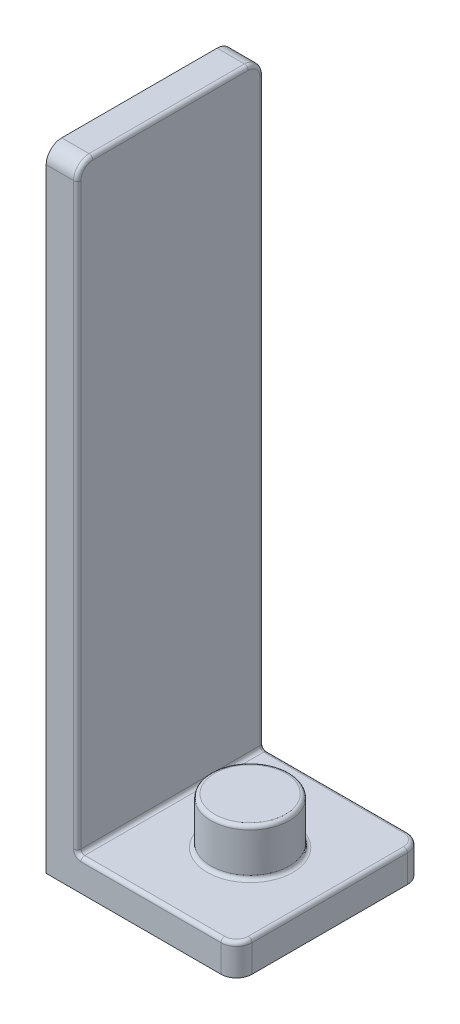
ISO-10303-21;
HEADER;
FILE_DESCRIPTION(('STEP AP214'),'2;1');
FILE_NAME('part.step','',(''),(''),'','','');
FILE_SCHEMA(('AUTOMOTIVE_DESIGN { 1 0 10303 214 1 1 1 1 }'));
ENDSEC;
DATA;
#1=APPLICATION_CONTEXT('core data for automotive mechanical design processes');
#2=APPLICATION_PROTOCOL_DEFINITION('international standard','automotive_design',2000,#1);
#3=PRODUCT_CONTEXT('',#1,'mechanical');
#4=PRODUCT('Part','Part','',(#3));
#5=PRODUCT_RELATED_PRODUCT_CATEGORY('part','',(#4));
#6=PRODUCT_DEFINITION_FORMATION('','',#4);
#7=PRODUCT_DEFINITION_CONTEXT('part definition',#1,'design');
#8=PRODUCT_DEFINITION('design','',#6,#7);
#9=PRODUCT_DEFINITION_SHAPE('','',#8);
#10=(LENGTH_UNIT() NAMED_UNIT(*) SI_UNIT(.MILLI.,.METRE.));
#11=(NAMED_UNIT(*) PLANE_ANGLE_UNIT() SI_UNIT($,.RADIAN.));
#12=(NAMED_UNIT(*) SI_UNIT($,.STERADIAN.) SOLID_ANGLE_UNIT());
#13=UNCERTAINTY_MEASURE_WITH_UNIT(LENGTH_MEASURE(1.E-05),#10,'distance_accuracy_value','');
#14=(GEOMETRIC_REPRESENTATION_CONTEXT(3) GLOBAL_UNCERTAINTY_ASSIGNED_CONTEXT((#13)) GLOBAL_UNIT_ASSIGNED_CONTEXT((#10,
#11,#12)) REPRESENTATION_CONTEXT('',''));
#15=CARTESIAN_POINT('',(0.,0.,0.));
#16=DIRECTION('',(0.,0.,1.));
#17=DIRECTION('',(1.,0.,0.));
#18=AXIS2_PLACEMENT_3D('',#15,#16,#17);
#19=CARTESIAN_POINT('',(0.,0.,38.1));
#20=DIRECTION('',(0.,1.,0.));
#21=DIRECTION('',(-1.,0.,0.));
#22=AXIS2_PLACEMENT_3D('',#19,#20,#21);
#23=PLANE('',#22);
#24=CARTESIAN_POINT('',(58.7375,0.,-31.75));
#25=DIRECTION('',(0.,1.,0.));
#26=DIRECTION('',(-1.,0.,0.));
#27=AXIS2_PLACEMENT_3D('',#24,#25,#26);
#28=CIRCLE('',#27,4.826);
#29=CARTESIAN_POINT('',(63.5635,0.,-31.75));
#30=VERTEX_POINT('',#29);
#31=CARTESIAN_POINT('',(58.7375,0.,-36.576));
#32=VERTEX_POINT('',#31);
#33=EDGE_CURVE('E259',#30,#32,#28,.T.);
#34=ORIENTED_EDGE('',*,*,#33,.T.);
#35=DIRECTION('',(1.,0.,0.));
#36=VECTOR('',#35,1.);
#37=CARTESIAN_POINT('',(0.,0.,-36.576));
#38=LINE('',#37,#36);
#39=CARTESIAN_POINT('',(1.524,0.,-36.576));
#40=VERTEX_POINT('',#39);
#41=EDGE_CURVE('E261',#32,#40,#38,.F.);
#42=ORIENTED_EDGE('',*,*,#41,.T.);
#43=DIRECTION('',(0.,0.,-1.));
#44=VECTOR('',#43,1.);
#45=CARTESIAN_POINT('',(1.524,0.,38.1));
#46=LINE('',#45,#44);
#47=CARTESIAN_POINT('',(1.524,0.,36.576));
#48=VERTEX_POINT('',#47);
#49=EDGE_CURVE('E251',#40,#48,#46,.F.);
#50=ORIENTED_EDGE('',*,*,#49,.T.);
#51=DIRECTION('',(1.,0.,0.));
#52=VECTOR('',#51,1.);
#53=CARTESIAN_POINT('',(58.7375,0.,36.576));
#54=LINE('',#53,#52);
#55=CARTESIAN_POINT('',(58.7375,0.,36.576));
#56=VERTEX_POINT('',#55);
#57=EDGE_CURVE('E253',#48,#56,#54,.T.);
#58=ORIENTED_EDGE('',*,*,#57,.T.);
#59=CARTESIAN_POINT('',(58.7375,0.,31.75));
#60=DIRECTION('',(0.,1.,0.));
#61=DIRECTION('',(-1.,0.,0.));
#62=AXIS2_PLACEMENT_3D('',#59,#60,#61);
#63=CIRCLE('',#62,4.826);
#64=CARTESIAN_POINT('',(63.5635,0.,31.75));
#65=VERTEX_POINT('',#64);
#66=EDGE_CURVE('E255',#56,#65,#63,.T.);
#67=ORIENTED_EDGE('',*,*,#66,.T.);
#68=DIRECTION('',(0.,0.,-1.));
#69=VECTOR('',#68,1.);
#70=CARTESIAN_POINT('',(63.5635,0.,38.1));
#71=LINE('',#70,#69);
#72=EDGE_CURVE('E257',#65,#30,#71,.T.);
#73=ORIENTED_EDGE('',*,*,#72,.T.);
#74=EDGE_LOOP('',(#34,#42,#50,#58,#67,#73));
#75=FACE_BOUND('',#74,.T.);
#76=CARTESIAN_POINT('',(32.54375,0.,0.));
#77=DIRECTION('',(0.,1.,0.));
#78=DIRECTION('',(-1.,0.,0.));
#79=AXIS2_PLACEMENT_3D('',#76,#77,#78);
#80=CIRCLE('',#79,17.5508006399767);
#81=CARTESIAN_POINT('',(14.9929493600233,0.,0.));
#82=VERTEX_POINT('',#81);
#83=EDGE_CURVE('E248',#82,#82,#80,.F.);
#84=ORIENTED_EDGE('',*,*,#83,.T.);
#85=EDGE_LOOP('',(#84));
#86=FACE_BOUND('',#85,.T.);
#87=ADVANCED_FACE('F31',(#75,#86),#23,.T.);
#88=CARTESIAN_POINT('',(0.,-12.7,38.1));
#89=DIRECTION('',(0.,1.,0.));
#90=DIRECTION('',(-1.,0.,0.));
#91=AXIS2_PLACEMENT_3D('',#88,#89,#90);
#92=PLANE('',#91);
#93=DIRECTION('',(1.,0.,0.));
#94=VECTOR('',#93,1.);
#95=CARTESIAN_POINT('',(0.,-12.7,-38.1));
#96=LINE('',#95,#94);
#97=CARTESIAN_POINT('',(-12.7,-12.7,-38.1));
#98=VERTEX_POINT('',#97);
#99=CARTESIAN_POINT('',(58.7375,-12.7,-38.1));
#100=VERTEX_POINT('',#99);
#101=EDGE_CURVE('E182',#98,#100,#96,.T.);
#102=ORIENTED_EDGE('',*,*,#101,.T.);
#103=CARTESIAN_POINT('',(58.7375,-12.7,-31.75));
#104=DIRECTION('',(0.,1.,0.));
#105=DIRECTION('',(-1.,0.,0.));
#106=AXIS2_PLACEMENT_3D('',#103,#104,#105);
#107=CIRCLE('',#106,6.35);
#108=CARTESIAN_POINT('',(65.0875,-12.7,-31.75));
#109=VERTEX_POINT('',#108);
#110=EDGE_CURVE('E196',#100,#109,#107,.F.);
#111=ORIENTED_EDGE('',*,*,#110,.T.);
#112=DIRECTION('',(0.,0.,-1.));
#113=VECTOR('',#112,1.);
#114=CARTESIAN_POINT('',(65.0875,-12.7,38.1));
#115=LINE('',#114,#113);
#116=CARTESIAN_POINT('',(65.0875,-12.7,31.75));
#117=VERTEX_POINT('',#116);
#118=EDGE_CURVE('E187',#117,#109,#115,.T.);
#119=ORIENTED_EDGE('',*,*,#118,.F.);
#120=CARTESIAN_POINT('',(58.7375,-12.7,31.75));
#121=DIRECTION('',(0.,1.,0.));
#122=DIRECTION('',(-1.,0.,0.));
#123=AXIS2_PLACEMENT_3D('',#120,#121,#122);
#124=CIRCLE('',#123,6.35);
#125=CARTESIAN_POINT('',(58.7375,-12.7,38.1));
#126=VERTEX_POINT('',#125);
#127=EDGE_CURVE('E180',#117,#126,#124,.F.);
#128=ORIENTED_EDGE('',*,*,#127,.T.);
#129=DIRECTION('',(1.,0.,0.));
#130=VECTOR('',#129,1.);
#131=CARTESIAN_POINT('',(0.,-12.7,38.1));
#132=LINE('',#131,#130);
#133=CARTESIAN_POINT('',(-12.7,-12.7,38.1));
#134=VERTEX_POINT('',#133);
#135=EDGE_CURVE('E159',#134,#126,#132,.T.);
#136=ORIENTED_EDGE('',*,*,#135,.F.);
#137=DIRECTION('',(0.,0.,-1.));
#138=VECTOR('',#137,1.);
#139=CARTESIAN_POINT('',(-12.7,-12.7,38.1));
#140=LINE('',#139,#138);
#141=EDGE_CURVE('E165',#134,#98,#140,.T.);
#142=ORIENTED_EDGE('',*,*,#141,.T.);
#143=EDGE_LOOP('',(#102,#111,#119,#128,#136,#142));
#144=FACE_BOUND('',#143,.T.);
#145=ADVANCED_FACE('F177',(#144),#92,.F.);
#146=CARTESIAN_POINT('',(65.0875,0.,38.1));
#147=DIRECTION('',(1.,0.,0.));
#148=DIRECTION('',(0.,0.,-1.));
#149=AXIS2_PLACEMENT_3D('',#146,#147,#148);
#150=PLANE('',#149);
#151=DIRECTION('',(0.,-1.,0.));
#152=VECTOR('',#151,1.);
#153=CARTESIAN_POINT('',(65.0875,0.,-31.75));
#154=LINE('',#153,#152);
#155=CARTESIAN_POINT('',(65.0875,-1.524,-31.75));
#156=VERTEX_POINT('',#155);
#157=EDGE_CURVE('E200',#109,#156,#154,.F.);
#158=ORIENTED_EDGE('',*,*,#157,.T.);
#159=DIRECTION('',(0.,0.,-1.));
#160=VECTOR('',#159,1.);
#161=CARTESIAN_POINT('',(65.0875,-1.524,38.1));
#162=LINE('',#161,#160);
#163=CARTESIAN_POINT('',(65.0875,-1.52399999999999,31.75));
#164=VERTEX_POINT('',#163);
#165=EDGE_CURVE('E48',#156,#164,#162,.F.);
#166=ORIENTED_EDGE('',*,*,#165,.T.);
#167=DIRECTION('',(0.,-1.,0.));
#168=VECTOR('',#167,1.);
#169=CARTESIAN_POINT('',(65.0875,-12.7,31.75));
#170=LINE('',#169,#168);
#171=EDGE_CURVE('E198',#164,#117,#170,.T.);
#172=ORIENTED_EDGE('',*,*,#171,.T.);
#173=ORIENTED_EDGE('',*,*,#118,.T.);
#174=EDGE_LOOP('',(#158,#166,#172,#173));
#175=FACE_BOUND('',#174,.T.);
#176=ADVANCED_FACE('F340',(#175),#150,.T.);
#177=CARTESIAN_POINT('',(0.,244.475,38.1));
#178=DIRECTION('',(1.,0.,0.));
#179=DIRECTION('',(0.,1.,0.));
#180=AXIS2_PLACEMENT_3D('',#177,#178,#179);
#181=PLANE('',#180);
#182=CARTESIAN_POINT('',(0.,238.125,-31.75));
#183=DIRECTION('',(1.,0.,0.));
#184=DIRECTION('',(0.,1.,0.));
#185=AXIS2_PLACEMENT_3D('',#182,#183,#184);
#186=CIRCLE('',#185,4.826);
#187=CARTESIAN_POINT('',(0.,238.125,-36.576));
#188=VERTEX_POINT('',#187);
#189=CARTESIAN_POINT('',(0.,242.951,-31.75));
#190=VERTEX_POINT('',#189);
#191=EDGE_CURVE('E225',#188,#190,#186,.T.);
#192=ORIENTED_EDGE('',*,*,#191,.T.);
#193=DIRECTION('',(0.,0.,-1.));
#194=VECTOR('',#193,1.);
#195=CARTESIAN_POINT('',(0.,242.951,38.1));
#196=LINE('',#195,#194);
#197=CARTESIAN_POINT('',(0.,242.951,31.75));
#198=VERTEX_POINT('',#197);
#199=EDGE_CURVE('E227',#190,#198,#196,.F.);
#200=ORIENTED_EDGE('',*,*,#199,.T.);
#201=CARTESIAN_POINT('',(0.,238.125,31.75));
#202=DIRECTION('',(1.,0.,0.));
#203=DIRECTION('',(0.,1.,0.));
#204=AXIS2_PLACEMENT_3D('',#201,#202,#203);
#205=CIRCLE('',#204,4.826);
#206=CARTESIAN_POINT('',(0.,238.125,36.576));
#207=VERTEX_POINT('',#206);
#208=EDGE_CURVE('E223',#198,#207,#205,.T.);
#209=ORIENTED_EDGE('',*,*,#208,.T.);
#210=DIRECTION('',(0.,-1.,0.));
#211=VECTOR('',#210,1.);
#212=CARTESIAN_POINT('',(0.,0.,36.576));
#213=LINE('',#212,#211);
#214=CARTESIAN_POINT('',(0.,1.524,36.576));
#215=VERTEX_POINT('',#214);
#216=EDGE_CURVE('E219',#207,#215,#213,.T.);
#217=ORIENTED_EDGE('',*,*,#216,.T.);
#218=DIRECTION('',(0.,0.,-1.));
#219=VECTOR('',#218,1.);
#220=CARTESIAN_POINT('',(0.,1.524,-38.1));
#221=LINE('',#220,#219);
#222=CARTESIAN_POINT('',(0.,1.524,-36.576));
#223=VERTEX_POINT('',#222);
#224=EDGE_CURVE('E217',#215,#223,#221,.T.);
#225=ORIENTED_EDGE('',*,*,#224,.T.);
#226=DIRECTION('',(0.,-1.,0.));
#227=VECTOR('',#226,1.);
#228=CARTESIAN_POINT('',(0.,244.475,-36.576));
#229=LINE('',#228,#227);
#230=EDGE_CURVE('E221',#223,#188,#229,.F.);
#231=ORIENTED_EDGE('',*,*,#230,.T.);
#232=EDGE_LOOP('',(#192,#200,#209,#217,#225,#231));
#233=FACE_BOUND('',#232,.T.);
#234=ADVANCED_FACE('F361',(#233),#181,.T.);
#235=CARTESIAN_POINT('',(-12.7,244.475,38.1));
#236=DIRECTION('',(0.,1.,0.));
#237=DIRECTION('',(0.,0.,1.));
#238=AXIS2_PLACEMENT_3D('',#235,#236,#237);
#239=PLANE('',#238);
#240=DIRECTION('',(1.,0.,0.));
#241=VECTOR('',#240,1.);
#242=CARTESIAN_POINT('',(0.,244.475,31.75));
#243=LINE('',#242,#241);
#244=CARTESIAN_POINT('',(-12.7,244.475,31.75));
#245=VERTEX_POINT('',#244);
#246=CARTESIAN_POINT('',(-1.524,244.475,31.75));
#247=VERTEX_POINT('',#246);
#248=EDGE_CURVE('E205',#245,#247,#243,.T.);
#249=ORIENTED_EDGE('',*,*,#248,.T.);
#250=DIRECTION('',(0.,0.,-1.));
#251=VECTOR('',#250,1.);
#252=CARTESIAN_POINT('',(-1.524,244.475,38.1));
#253=LINE('',#252,#251);
#254=CARTESIAN_POINT('',(-1.524,244.475,-31.75));
#255=VERTEX_POINT('',#254);
#256=EDGE_CURVE('E214',#247,#255,#253,.T.);
#257=ORIENTED_EDGE('',*,*,#256,.T.);
#258=DIRECTION('',(1.,0.,0.));
#259=VECTOR('',#258,1.);
#260=CARTESIAN_POINT('',(-12.7,244.475,-31.75));
#261=LINE('',#260,#259);
#262=CARTESIAN_POINT('',(-12.7,244.475,-31.75));
#263=VERTEX_POINT('',#262);
#264=EDGE_CURVE('E208',#255,#263,#261,.F.);
#265=ORIENTED_EDGE('',*,*,#264,.T.);
#266=DIRECTION('',(0.,0.,-1.));
#267=VECTOR('',#266,1.);
#268=CARTESIAN_POINT('',(-12.7,244.475,38.1));
#269=LINE('',#268,#267);
#270=EDGE_CURVE('E175',#245,#263,#269,.T.);
#271=ORIENTED_EDGE('',*,*,#270,.F.);
#272=EDGE_LOOP('',(#249,#257,#265,#271));
#273=FACE_BOUND('',#272,.T.);
#274=ADVANCED_FACE('F378',(#273),#239,.T.);
#275=CARTESIAN_POINT('',(-12.7,244.475,38.1));
#276=DIRECTION('',(1.,0.,0.));
#277=DIRECTION('',(0.,1.,0.));
#278=AXIS2_PLACEMENT_3D('',#275,#276,#277);
#279=PLANE('',#278);
#280=ORIENTED_EDGE('',*,*,#270,.T.);
#281=CARTESIAN_POINT('',(-12.7,238.125,-31.75));
#282=DIRECTION('',(1.,0.,0.));
#283=DIRECTION('',(0.,1.,0.));
#284=AXIS2_PLACEMENT_3D('',#281,#282,#283);
#285=CIRCLE('',#284,6.35);
#286=CARTESIAN_POINT('',(-12.7,238.125,-38.1));
#287=VERTEX_POINT('',#286);
#288=EDGE_CURVE('E212',#263,#287,#285,.F.);
#289=ORIENTED_EDGE('',*,*,#288,.T.);
#290=DIRECTION('',(0.,-1.,0.));
#291=VECTOR('',#290,1.);
#292=CARTESIAN_POINT('',(-12.7,244.475,-38.1));
#293=LINE('',#292,#291);
#294=EDGE_CURVE('E171',#287,#98,#293,.T.);
#295=ORIENTED_EDGE('',*,*,#294,.T.);
#296=ORIENTED_EDGE('',*,*,#141,.F.);
#297=DIRECTION('',(0.,-1.,0.));
#298=VECTOR('',#297,1.);
#299=CARTESIAN_POINT('',(-12.7,244.475,38.1));
#300=LINE('',#299,#298);
#301=CARTESIAN_POINT('',(-12.7,238.125,38.1));
#302=VERTEX_POINT('',#301);
#303=EDGE_CURVE('E154',#302,#134,#300,.T.);
#304=ORIENTED_EDGE('',*,*,#303,.F.);
#305=CARTESIAN_POINT('',(-12.7,238.125,31.75));
#306=DIRECTION('',(1.,0.,0.));
#307=DIRECTION('',(0.,1.,0.));
#308=AXIS2_PLACEMENT_3D('',#305,#306,#307);
#309=CIRCLE('',#308,6.35);
#310=EDGE_CURVE('E210',#302,#245,#309,.F.);
#311=ORIENTED_EDGE('',*,*,#310,.T.);
#312=EDGE_LOOP('',(#280,#289,#295,#296,#304,#311));
#313=FACE_BOUND('',#312,.T.);
#314=ADVANCED_FACE('F169',(#313),#279,.F.);
#315=CARTESIAN_POINT('',(65.0875,-12.7,38.1));
#316=DIRECTION('',(0.,0.,-1.));
#317=DIRECTION('',(-1.,0.,0.));
#318=AXIS2_PLACEMENT_3D('',#315,#316,#317);
#319=PLANE('',#318);
#320=CARTESIAN_POINT('',(1.524,1.524,38.1));
#321=DIRECTION('',(0.,0.,-1.));
#322=DIRECTION('',(-1.,0.,0.));
#323=AXIS2_PLACEMENT_3D('',#320,#321,#322);
#324=CIRCLE('',#323,3.048);
#325=CARTESIAN_POINT('',(-1.524,1.524,38.1));
#326=VERTEX_POINT('',#325);
#327=CARTESIAN_POINT('',(1.524,-1.524,38.1));
#328=VERTEX_POINT('',#327);
#329=EDGE_CURVE('E241',#326,#328,#324,.F.);
#330=ORIENTED_EDGE('',*,*,#329,.F.);
#331=DIRECTION('',(0.,-1.,0.));
#332=VECTOR('',#331,1.);
#333=CARTESIAN_POINT('',(-1.524,238.125,38.1));
#334=LINE('',#333,#332);
#335=CARTESIAN_POINT('',(-1.524,238.125,38.1));
#336=VERTEX_POINT('',#335);
#337=EDGE_CURVE('E246',#326,#336,#334,.F.);
#338=ORIENTED_EDGE('',*,*,#337,.T.);
#339=DIRECTION('',(1.,0.,0.));
#340=VECTOR('',#339,1.);
#341=CARTESIAN_POINT('',(-12.7,238.125,38.1));
#342=LINE('',#341,#340);
#343=EDGE_CURVE('E162',#336,#302,#342,.F.);
#344=ORIENTED_EDGE('',*,*,#343,.T.);
#345=ORIENTED_EDGE('',*,*,#303,.T.);
#346=ORIENTED_EDGE('',*,*,#135,.T.);
#347=DIRECTION('',(0.,-1.,0.));
#348=VECTOR('',#347,1.);
#349=CARTESIAN_POINT('',(58.7375,0.,38.1));
#350=LINE('',#349,#348);
#351=CARTESIAN_POINT('',(58.7375,-1.524,38.1));
#352=VERTEX_POINT('',#351);
#353=EDGE_CURVE('E203',#126,#352,#350,.F.);
#354=ORIENTED_EDGE('',*,*,#353,.T.);
#355=DIRECTION('',(1.,0.,0.));
#356=VECTOR('',#355,1.);
#357=CARTESIAN_POINT('',(0.,-1.524,38.1));
#358=LINE('',#357,#356);
#359=EDGE_CURVE('E244',#352,#328,#358,.F.);
#360=ORIENTED_EDGE('',*,*,#359,.T.);
#361=EDGE_LOOP('',(#330,#338,#344,#345,#346,#354,#360));
#362=FACE_BOUND('',#361,.T.);
#363=ADVANCED_FACE('F156',(#362),#319,.F.);
#364=CARTESIAN_POINT('',(65.0875,-12.7,-38.1));
#365=DIRECTION('',(0.,0.,-1.));
#366=DIRECTION('',(-1.,0.,0.));
#367=AXIS2_PLACEMENT_3D('',#364,#365,#366);
#368=PLANE('',#367);
#369=DIRECTION('',(1.,0.,0.));
#370=VECTOR('',#369,1.);
#371=CARTESIAN_POINT('',(65.0875,238.125,-38.1));
#372=LINE('',#371,#370);
#373=CARTESIAN_POINT('',(-1.524,238.125,-38.1));
#374=VERTEX_POINT('',#373);
#375=EDGE_CURVE('E190',#287,#374,#372,.T.);
#376=ORIENTED_EDGE('',*,*,#375,.T.);
#377=DIRECTION('',(0.,-1.,0.));
#378=VECTOR('',#377,1.);
#379=CARTESIAN_POINT('',(-1.524,-12.7,-38.1));
#380=LINE('',#379,#378);
#381=CARTESIAN_POINT('',(-1.524,1.524,-38.1));
#382=VERTEX_POINT('',#381);
#383=EDGE_CURVE('E239',#374,#382,#380,.T.);
#384=ORIENTED_EDGE('',*,*,#383,.T.);
#385=CARTESIAN_POINT('',(1.524,1.524,-38.1));
#386=DIRECTION('',(0.,0.,-1.));
#387=DIRECTION('',(-1.,0.,0.));
#388=AXIS2_PLACEMENT_3D('',#385,#386,#387);
#389=CIRCLE('',#388,3.048);
#390=CARTESIAN_POINT('',(1.524,-1.524,-38.1));
#391=VERTEX_POINT('',#390);
#392=EDGE_CURVE('E236',#391,#382,#389,.T.);
#393=ORIENTED_EDGE('',*,*,#392,.F.);
#394=DIRECTION('',(1.,0.,0.));
#395=VECTOR('',#394,1.);
#396=CARTESIAN_POINT('',(65.0875,-1.524,-38.1));
#397=LINE('',#396,#395);
#398=CARTESIAN_POINT('',(58.7375,-1.524,-38.1));
#399=VERTEX_POINT('',#398);
#400=EDGE_CURVE('E234',#391,#399,#397,.T.);
#401=ORIENTED_EDGE('',*,*,#400,.T.);
#402=DIRECTION('',(0.,-1.,0.));
#403=VECTOR('',#402,1.);
#404=CARTESIAN_POINT('',(58.7375,-12.7,-38.1));
#405=LINE('',#404,#403);
#406=EDGE_CURVE('E193',#399,#100,#405,.T.);
#407=ORIENTED_EDGE('',*,*,#406,.T.);
#408=ORIENTED_EDGE('',*,*,#101,.F.);
#409=ORIENTED_EDGE('',*,*,#294,.F.);
#410=EDGE_LOOP('',(#376,#384,#393,#401,#407,#408,#409));
#411=FACE_BOUND('',#410,.T.);
#412=ADVANCED_FACE('F344',(#411),#368,.T.);
#413=CARTESIAN_POINT('',(32.54375,19.05,0.));
#414=DIRECTION('',(0.,-1.,0.));
#415=DIRECTION('',(0.,0.,-1.));
#416=AXIS2_PLACEMENT_3D('',#413,#414,#415);
#417=CYLINDRICAL_SURFACE('',#416,16.0268006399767);
#418=CARTESIAN_POINT('',(32.54375,17.526,0.));
#419=DIRECTION('',(0.,1.,0.));
#420=DIRECTION('',(0.,0.,1.));
#421=AXIS2_PLACEMENT_3D('',#418,#419,#420);
#422=CIRCLE('',#421,16.0268006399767);
#423=CARTESIAN_POINT('',(32.54375,17.526,-16.0268006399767));
#424=VERTEX_POINT('',#423);
#425=EDGE_CURVE('E11',#424,#424,#422,.F.);
#426=CARTESIAN_POINT('',(32.54375,1.52400000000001,0.));
#427=DIRECTION('',(0.,1.,0.));
#428=DIRECTION('',(-1.,0.,0.));
#429=AXIS2_PLACEMENT_3D('',#426,#427,#428);
#430=CIRCLE('',#429,16.0268006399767);
#431=CARTESIAN_POINT('',(32.54375,1.52400000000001,-16.0268006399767));
#432=VERTEX_POINT('',#431);
#433=EDGE_CURVE('E40',#432,#432,#430,.T.);
#434=CARTESIAN_POINT('',(32.54375,17.526,-16.0268006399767));
#435=CARTESIAN_POINT('',(32.54375,17.3593125,-16.0268006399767));
#436=CARTESIAN_POINT('',(32.54375,17.192625,-16.0268006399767));
#437=CARTESIAN_POINT('',(32.54375,16.85925,-16.0268006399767));
#438=CARTESIAN_POINT('',(32.54375,16.6925625,-16.0268006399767));
#439=CARTESIAN_POINT('',(32.54375,16.3591875,-16.0268006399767));
#440=CARTESIAN_POINT('',(32.54375,16.1925,-16.0268006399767));
#441=CARTESIAN_POINT('',(32.54375,15.859125,-16.0268006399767));
#442=CARTESIAN_POINT('',(32.54375,15.6924375,-16.0268006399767));
#443=CARTESIAN_POINT('',(32.54375,15.3590625,-16.0268006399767));
#444=CARTESIAN_POINT('',(32.54375,15.192375,-16.0268006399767));
#445=CARTESIAN_POINT('',(32.54375,14.859,-16.0268006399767));
#446=CARTESIAN_POINT('',(32.54375,14.6923125,-16.0268006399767));
#447=CARTESIAN_POINT('',(32.54375,14.3589375,-16.0268006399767));
#448=CARTESIAN_POINT('',(32.54375,14.19225,-16.0268006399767));
#449=CARTESIAN_POINT('',(32.54375,13.858875,-16.0268006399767));
#450=CARTESIAN_POINT('',(32.54375,13.6921875,-16.0268006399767));
#451=CARTESIAN_POINT('',(32.54375,13.3588125,-16.0268006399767));
#452=CARTESIAN_POINT('',(32.54375,13.192125,-16.0268006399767));
#453=CARTESIAN_POINT('',(32.54375,12.85875,-16.0268006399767));
#454=CARTESIAN_POINT('',(32.54375,12.6920625,-16.0268006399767));
#455=CARTESIAN_POINT('',(32.54375,12.3586875,-16.0268006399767));
#456=CARTESIAN_POINT('',(32.54375,12.192,-16.0268006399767));
#457=CARTESIAN_POINT('',(32.54375,11.858625,-16.0268006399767));
#458=CARTESIAN_POINT('',(32.54375,11.6919375,-16.0268006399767));
#459=CARTESIAN_POINT('',(32.54375,11.3585625,-16.0268006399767));
#460=CARTESIAN_POINT('',(32.54375,11.191875,-16.0268006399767));
#461=CARTESIAN_POINT('',(32.54375,10.8585,-16.0268006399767));
#462=CARTESIAN_POINT('',(32.54375,10.6918125,-16.0268006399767));
#463=CARTESIAN_POINT('',(32.54375,10.3584375,-16.0268006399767));
#464=CARTESIAN_POINT('',(32.54375,10.19175,-16.0268006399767));
#465=CARTESIAN_POINT('',(32.54375,9.858375,-16.0268006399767));
#466=CARTESIAN_POINT('',(32.54375,9.69168750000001,-16.0268006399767));
#467=CARTESIAN_POINT('',(32.54375,9.35831250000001,-16.0268006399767));
#468=CARTESIAN_POINT('',(32.54375,9.19162500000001,-16.0268006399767));
#469=CARTESIAN_POINT('',(32.54375,8.85825000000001,-16.0268006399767));
#470=CARTESIAN_POINT('',(32.54375,8.69156250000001,-16.0268006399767));
#471=CARTESIAN_POINT('',(32.54375,8.35818750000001,-16.0268006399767));
#472=CARTESIAN_POINT('',(32.54375,8.19150000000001,-16.0268006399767));
#473=CARTESIAN_POINT('',(32.54375,7.85812500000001,-16.0268006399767));
#474=CARTESIAN_POINT('',(32.54375,7.69143750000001,-16.0268006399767));
#475=CARTESIAN_POINT('',(32.54375,7.35806250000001,-16.0268006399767));
#476=CARTESIAN_POINT('',(32.54375,7.19137500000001,-16.0268006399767));
#477=CARTESIAN_POINT('',(32.54375,6.85800000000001,-16.0268006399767));
#478=CARTESIAN_POINT('',(32.54375,6.69131250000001,-16.0268006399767));
#479=CARTESIAN_POINT('',(32.54375,6.35793750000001,-16.0268006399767));
#480=CARTESIAN_POINT('',(32.54375,6.19125000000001,-16.0268006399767));
#481=CARTESIAN_POINT('',(32.54375,5.85787500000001,-16.0268006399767));
#482=CARTESIAN_POINT('',(32.54375,5.69118750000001,-16.0268006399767));
#483=CARTESIAN_POINT('',(32.54375,5.35781250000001,-16.0268006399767));
#484=CARTESIAN_POINT('',(32.54375,5.19112500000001,-16.0268006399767));
#485=CARTESIAN_POINT('',(32.54375,4.85775000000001,-16.0268006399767));
#486=CARTESIAN_POINT('',(32.54375,4.69106250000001,-16.0268006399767));
#487=CARTESIAN_POINT('',(32.54375,4.35768750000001,-16.0268006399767));
#488=CARTESIAN_POINT('',(32.54375,4.19100000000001,-16.0268006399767));
#489=CARTESIAN_POINT('',(32.54375,3.85762500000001,-16.0268006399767));
#490=CARTESIAN_POINT('',(32.54375,3.69093750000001,-16.0268006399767));
#491=CARTESIAN_POINT('',(32.54375,3.35756250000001,-16.0268006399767));
#492=CARTESIAN_POINT('',(32.54375,3.19087500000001,-16.0268006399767));
#493=CARTESIAN_POINT('',(32.54375,2.85750000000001,-16.0268006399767));
#494=CARTESIAN_POINT('',(32.54375,2.69081250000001,-16.0268006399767));
#495=CARTESIAN_POINT('',(32.54375,2.35743750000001,-16.0268006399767));
#496=CARTESIAN_POINT('',(32.54375,2.19075000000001,-16.0268006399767));
#497=CARTESIAN_POINT('',(32.54375,1.85737500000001,-16.0268006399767));
#498=CARTESIAN_POINT('',(32.54375,1.69068750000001,-16.0268006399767));
#499=CARTESIAN_POINT('',(32.54375,1.52400000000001,-16.0268006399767));
#500=B_SPLINE_CURVE_WITH_KNOTS('',3,(#434,#435,#436,#437,#438,#439,#440,#441,#442,#443,#444,
#445,#446,#447,#448,#449,#450,#451,#452,#453,#454,#455,#456,#457,#458,#459,#460,#461,#462,#463,
#464,#465,#466,#467,#468,#469,#470,#471,#472,#473,#474,#475,#476,#477,#478,#479,#480,#481,#482,
#483,#484,#485,#486,#487,#488,#489,#490,#491,#492,#493,#494,#495,#496,#497,#498,#499),
.UNSPECIFIED.,.F.,.F.,(4,2,2,2,2,2,2,2,2,2,2,2,2,2,2,2,2,2,2,2,2,2,2,2,2,2,2,2,2,2,2,2,4),(0.,
0.500062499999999,1.000125,1.5001875,2.00025,2.5003125,3.000375,3.50043749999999,
4.00049999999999,4.5005625,5.00062499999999,5.50068749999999,6.00074999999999,6.50081249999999,
7.00087499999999,7.50093749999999,8.00099999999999,8.50106249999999,9.00112499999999,
9.50118749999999,10.00125,10.5013125,11.001375,11.5014375,12.0015,12.5015625,13.001625,
13.5016875,14.00175,14.5018125,15.001875,15.5019375,16.002),.UNSPECIFIED.);
#501=EDGE_CURVE('BSEAM478',#424,#432,#500,.T.);
#502=ORIENTED_EDGE('',*,*,#425,.T.);
#503=ORIENTED_EDGE('',*,*,#433,.T.);
#504=ORIENTED_EDGE('',*,*,#501,.T.);
#505=ORIENTED_EDGE('',*,*,#501,.F.);
#506=EDGE_LOOP('',(#502,#504,#503,#505));
#507=FACE_BOUND('',#506,.T.);
#508=ADVANCED_FACE('F478',(#507),#417,.T.);
#509=CARTESIAN_POINT('',(32.54375,19.05,0.));
#510=DIRECTION('',(0.,1.,0.));
#511=DIRECTION('',(0.,0.,1.));
#512=AXIS2_PLACEMENT_3D('',#509,#510,#511);
#513=PLANE('',#512);
#514=CARTESIAN_POINT('',(32.54375,19.05,0.));
#515=DIRECTION('',(0.,1.,0.));
#516=DIRECTION('',(0.,0.,1.));
#517=AXIS2_PLACEMENT_3D('',#514,#515,#516);
#518=CIRCLE('',#517,14.5028006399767);
#519=CARTESIAN_POINT('',(32.54375,19.05,14.5028006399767));
#520=VERTEX_POINT('',#519);
#521=EDGE_CURVE('E268',#520,#520,#518,.T.);
#522=ORIENTED_EDGE('',*,*,#521,.T.);
#523=EDGE_LOOP('',(#522));
#524=FACE_BOUND('',#523,.T.);
#525=ADVANCED_FACE('F412',(#524),#513,.T.);
#526=CARTESIAN_POINT('',(58.7375,-12.7,-31.75));
#527=DIRECTION('',(0.,-1.,0.));
#528=DIRECTION('',(0.,0.,-1.));
#529=AXIS2_PLACEMENT_3D('',#526,#527,#528);
#530=CYLINDRICAL_SURFACE('',#529,6.35);
#531=ORIENTED_EDGE('',*,*,#406,.F.);
#532=CARTESIAN_POINT('',(58.7375,-1.52399999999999,-31.75));
#533=DIRECTION('',(0.,1.,0.));
#534=DIRECTION('',(-1.,0.,0.));
#535=AXIS2_PLACEMENT_3D('',#532,#533,#534);
#536=CIRCLE('',#535,6.35);
#537=EDGE_CURVE('E56',#399,#156,#536,.F.);
#538=ORIENTED_EDGE('',*,*,#537,.T.);
#539=ORIENTED_EDGE('',*,*,#157,.F.);
#540=ORIENTED_EDGE('',*,*,#110,.F.);
#541=EDGE_LOOP('',(#531,#538,#539,#540));
#542=FACE_BOUND('',#541,.T.);
#543=ADVANCED_FACE('F342',(#542),#530,.T.);
#544=CARTESIAN_POINT('',(58.7375,0.,31.75));
#545=DIRECTION('',(0.,1.,0.));
#546=DIRECTION('',(0.,0.,1.));
#547=AXIS2_PLACEMENT_3D('',#544,#545,#546);
#548=CYLINDRICAL_SURFACE('',#547,6.35);
#549=ORIENTED_EDGE('',*,*,#171,.F.);
#550=CARTESIAN_POINT('',(58.7375,-1.524,31.75));
#551=DIRECTION('',(0.,1.,0.));
#552=DIRECTION('',(-1.,0.,0.));
#553=AXIS2_PLACEMENT_3D('',#550,#551,#552);
#554=CIRCLE('',#553,6.35);
#555=EDGE_CURVE('E266',#164,#352,#554,.F.);
#556=ORIENTED_EDGE('',*,*,#555,.T.);
#557=ORIENTED_EDGE('',*,*,#353,.F.);
#558=ORIENTED_EDGE('',*,*,#127,.F.);
#559=EDGE_LOOP('',(#549,#556,#557,#558));
#560=FACE_BOUND('',#559,.T.);
#561=ADVANCED_FACE('F339',(#560),#548,.T.);
#562=CARTESIAN_POINT('',(65.0875,238.125,-31.75));
#563=DIRECTION('',(1.,0.,0.));
#564=DIRECTION('',(0.,0.,-1.));
#565=AXIS2_PLACEMENT_3D('',#562,#563,#564);
#566=CYLINDRICAL_SURFACE('',#565,6.35);
#567=ORIENTED_EDGE('',*,*,#264,.F.);
#568=CARTESIAN_POINT('',(-1.524,238.125,-31.75));
#569=DIRECTION('',(1.,0.,0.));
#570=DIRECTION('',(0.,1.,0.));
#571=AXIS2_PLACEMENT_3D('',#568,#569,#570);
#572=CIRCLE('',#571,6.35);
#573=EDGE_CURVE('E230',#255,#374,#572,.F.);
#574=ORIENTED_EDGE('',*,*,#573,.T.);
#575=ORIENTED_EDGE('',*,*,#375,.F.);
#576=ORIENTED_EDGE('',*,*,#288,.F.);
#577=EDGE_LOOP('',(#567,#574,#575,#576));
#578=FACE_BOUND('',#577,.T.);
#579=ADVANCED_FACE('F382',(#578),#566,.T.);
#580=CARTESIAN_POINT('',(-12.7,238.125,31.75));
#581=DIRECTION('',(-1.,0.,0.));
#582=DIRECTION('',(0.,0.,1.));
#583=AXIS2_PLACEMENT_3D('',#580,#581,#582);
#584=CYLINDRICAL_SURFACE('',#583,6.35);
#585=ORIENTED_EDGE('',*,*,#343,.F.);
#586=CARTESIAN_POINT('',(-1.524,238.125,31.75));
#587=DIRECTION('',(1.,0.,0.));
#588=DIRECTION('',(0.,1.,0.));
#589=AXIS2_PLACEMENT_3D('',#586,#587,#588);
#590=CIRCLE('',#589,6.35);
#591=EDGE_CURVE('E232',#336,#247,#590,.F.);
#592=ORIENTED_EDGE('',*,*,#591,.T.);
#593=ORIENTED_EDGE('',*,*,#248,.F.);
#594=ORIENTED_EDGE('',*,*,#310,.F.);
#595=EDGE_LOOP('',(#585,#592,#593,#594));
#596=FACE_BOUND('',#595,.T.);
#597=ADVANCED_FACE('F375',(#596),#584,.T.);
#598=CARTESIAN_POINT('',(63.5635,-1.524,38.1));
#599=DIRECTION('',(0.,0.,-1.));
#600=DIRECTION('',(-1.,0.,0.));
#601=AXIS2_PLACEMENT_3D('',#598,#599,#600);
#602=CYLINDRICAL_SURFACE('',#601,1.524);
#603=CARTESIAN_POINT('',(63.5635,-1.524,-31.75));
#604=DIRECTION('',(0.,0.,-1.));
#605=DIRECTION('',(-1.,0.,0.));
#606=AXIS2_PLACEMENT_3D('',#603,#604,#605);
#607=CIRCLE('',#606,1.524);
#608=EDGE_CURVE('E305',#30,#156,#607,.T.);
#609=ORIENTED_EDGE('',*,*,#608,.F.);
#610=ORIENTED_EDGE('',*,*,#72,.F.);
#611=CARTESIAN_POINT('',(63.5635,-1.524,31.75));
#612=DIRECTION('',(0.,0.,1.));
#613=DIRECTION('',(1.,0.,0.));
#614=AXIS2_PLACEMENT_3D('',#611,#612,#613);
#615=CIRCLE('',#614,1.524);
#616=EDGE_CURVE('E35',#164,#65,#615,.T.);
#617=ORIENTED_EDGE('',*,*,#616,.F.);
#618=ORIENTED_EDGE('',*,*,#165,.F.);
#619=EDGE_LOOP('',(#609,#610,#617,#618));
#620=FACE_BOUND('',#619,.T.);
#621=ADVANCED_FACE('F319',(#620),#602,.T.);
#622=CARTESIAN_POINT('',(58.7375,-1.524,31.75));
#623=DIRECTION('',(0.,1.,0.));
#624=DIRECTION('',(-1.,0.,0.));
#625=AXIS2_PLACEMENT_3D('',#622,#623,#624);
#626=TOROIDAL_SURFACE('',#625,4.826,1.524);
#627=ORIENTED_EDGE('',*,*,#616,.T.);
#628=ORIENTED_EDGE('',*,*,#66,.F.);
#629=CARTESIAN_POINT('',(58.7375,-1.524,36.576));
#630=DIRECTION('',(-1.,0.,0.));
#631=DIRECTION('',(0.,0.,1.));
#632=AXIS2_PLACEMENT_3D('',#629,#630,#631);
#633=CIRCLE('',#632,1.524);
#634=EDGE_CURVE('E303',#352,#56,#633,.T.);
#635=ORIENTED_EDGE('',*,*,#634,.F.);
#636=ORIENTED_EDGE('',*,*,#555,.F.);
#637=EDGE_LOOP('',(#627,#628,#635,#636));
#638=FACE_BOUND('',#637,.T.);
#639=ADVANCED_FACE('F315',(#638),#626,.T.);
#640=CARTESIAN_POINT('',(58.7375,-1.524,-31.75));
#641=DIRECTION('',(0.,1.,0.));
#642=DIRECTION('',(-1.,0.,0.));
#643=AXIS2_PLACEMENT_3D('',#640,#641,#642);
#644=TOROIDAL_SURFACE('',#643,4.826,1.524);
#645=ORIENTED_EDGE('',*,*,#608,.T.);
#646=ORIENTED_EDGE('',*,*,#537,.F.);
#647=CARTESIAN_POINT('',(58.7375,-1.524,-36.576));
#648=DIRECTION('',(-1.,0.,0.));
#649=DIRECTION('',(0.,0.,1.));
#650=AXIS2_PLACEMENT_3D('',#647,#648,#649);
#651=CIRCLE('',#650,1.524);
#652=EDGE_CURVE('E300',#32,#399,#651,.T.);
#653=ORIENTED_EDGE('',*,*,#652,.F.);
#654=ORIENTED_EDGE('',*,*,#33,.F.);
#655=EDGE_LOOP('',(#645,#646,#653,#654));
#656=FACE_BOUND('',#655,.T.);
#657=ADVANCED_FACE('F424',(#656),#644,.T.);
#658=CARTESIAN_POINT('',(0.,-1.524,36.576));
#659=DIRECTION('',(-1.,0.,0.));
#660=DIRECTION('',(0.,-1.,0.));
#661=AXIS2_PLACEMENT_3D('',#658,#659,#660);
#662=CYLINDRICAL_SURFACE('',#661,1.524);
#663=ORIENTED_EDGE('',*,*,#634,.T.);
#664=ORIENTED_EDGE('',*,*,#57,.F.);
#665=CARTESIAN_POINT('',(1.524,-1.524,36.576));
#666=DIRECTION('',(-1.,0.,0.));
#667=DIRECTION('',(0.,0.,1.));
#668=AXIS2_PLACEMENT_3D('',#665,#666,#667);
#669=CIRCLE('',#668,1.524);
#670=EDGE_CURVE('E294',#328,#48,#669,.T.);
#671=ORIENTED_EDGE('',*,*,#670,.F.);
#672=ORIENTED_EDGE('',*,*,#359,.F.);
#673=EDGE_LOOP('',(#663,#664,#671,#672));
#674=FACE_BOUND('',#673,.T.);
#675=ADVANCED_FACE('F328',(#674),#662,.T.);
#676=CARTESIAN_POINT('',(65.0875,-1.524,-36.576));
#677=DIRECTION('',(1.,0.,0.));
#678=DIRECTION('',(0.,1.,0.));
#679=AXIS2_PLACEMENT_3D('',#676,#677,#678);
#680=CYLINDRICAL_SURFACE('',#679,1.524);
#681=ORIENTED_EDGE('',*,*,#652,.T.);
#682=ORIENTED_EDGE('',*,*,#400,.F.);
#683=CARTESIAN_POINT('',(1.524,-1.524,-36.576));
#684=DIRECTION('',(-1.,0.,0.));
#685=DIRECTION('',(0.,0.,1.));
#686=AXIS2_PLACEMENT_3D('',#683,#684,#685);
#687=CIRCLE('',#686,1.524);
#688=EDGE_CURVE('E291',#40,#391,#687,.T.);
#689=ORIENTED_EDGE('',*,*,#688,.F.);
#690=ORIENTED_EDGE('',*,*,#41,.F.);
#691=EDGE_LOOP('',(#681,#682,#689,#690));
#692=FACE_BOUND('',#691,.T.);
#693=ADVANCED_FACE('F349',(#692),#680,.T.);
#694=CARTESIAN_POINT('',(1.524,1.524,38.1));
#695=DIRECTION('',(0.,0.,1.));
#696=DIRECTION('',(1.,0.,0.));
#697=AXIS2_PLACEMENT_3D('',#694,#695,#696);
#698=CYLINDRICAL_SURFACE('',#697,1.524);
#699=CARTESIAN_POINT('',(1.524,1.524,36.576));
#700=DIRECTION('',(0.,0.,-1.));
#701=DIRECTION('',(-1.,0.,0.));
#702=AXIS2_PLACEMENT_3D('',#699,#700,#701);
#703=CIRCLE('',#702,1.524);
#704=EDGE_CURVE('E297',#48,#215,#703,.T.);
#705=ORIENTED_EDGE('',*,*,#704,.F.);
#706=ORIENTED_EDGE('',*,*,#49,.F.);
#707=CARTESIAN_POINT('',(1.524,1.524,-36.576));
#708=DIRECTION('',(0.,0.,-1.));
#709=DIRECTION('',(-1.,0.,0.));
#710=AXIS2_PLACEMENT_3D('',#707,#708,#709);
#711=CIRCLE('',#710,1.524);
#712=EDGE_CURVE('E289',#223,#40,#711,.F.);
#713=ORIENTED_EDGE('',*,*,#712,.F.);
#714=ORIENTED_EDGE('',*,*,#224,.F.);
#715=EDGE_LOOP('',(#705,#706,#713,#714));
#716=FACE_BOUND('',#715,.T.);
#717=ADVANCED_FACE('F332',(#716),#698,.F.);
#718=CARTESIAN_POINT('',(1.524,1.524,36.576));
#719=DIRECTION('',(0.,0.,-1.));
#720=DIRECTION('',(-1.,0.,0.));
#721=AXIS2_PLACEMENT_3D('',#718,#719,#720);
#722=TOROIDAL_SURFACE('',#721,3.048,1.524);
#723=ORIENTED_EDGE('',*,*,#670,.T.);
#724=ORIENTED_EDGE('',*,*,#704,.T.);
#725=CARTESIAN_POINT('',(-1.524,1.524,36.576));
#726=DIRECTION('',(0.,-1.,0.));
#727=DIRECTION('',(0.,0.,-1.));
#728=AXIS2_PLACEMENT_3D('',#725,#726,#727);
#729=CIRCLE('',#728,1.524);
#730=EDGE_CURVE('E286',#326,#215,#729,.F.);
#731=ORIENTED_EDGE('',*,*,#730,.F.);
#732=ORIENTED_EDGE('',*,*,#329,.T.);
#733=EDGE_LOOP('',(#723,#724,#731,#732));
#734=FACE_BOUND('',#733,.T.);
#735=ADVANCED_FACE('F336',(#734),#722,.T.);
#736=CARTESIAN_POINT('',(1.524,1.524,-36.576));
#737=DIRECTION('',(0.,0.,-1.));
#738=DIRECTION('',(-1.,0.,0.));
#739=AXIS2_PLACEMENT_3D('',#736,#737,#738);
#740=TOROIDAL_SURFACE('',#739,3.048,1.524);
#741=ORIENTED_EDGE('',*,*,#688,.T.);
#742=ORIENTED_EDGE('',*,*,#392,.T.);
#743=CARTESIAN_POINT('',(-1.524,1.524,-36.576));
#744=DIRECTION('',(0.,-1.,0.));
#745=DIRECTION('',(0.,0.,-1.));
#746=AXIS2_PLACEMENT_3D('',#743,#744,#745);
#747=CIRCLE('',#746,1.524);
#748=EDGE_CURVE('E283',#223,#382,#747,.F.);
#749=ORIENTED_EDGE('',*,*,#748,.F.);
#750=ORIENTED_EDGE('',*,*,#712,.T.);
#751=EDGE_LOOP('',(#741,#742,#749,#750));
#752=FACE_BOUND('',#751,.T.);
#753=ADVANCED_FACE('F352',(#752),#740,.T.);
#754=CARTESIAN_POINT('',(-1.524,244.475,36.576));
#755=DIRECTION('',(0.,1.,0.));
#756=DIRECTION('',(-1.,0.,0.));
#757=AXIS2_PLACEMENT_3D('',#754,#755,#756);
#758=CYLINDRICAL_SURFACE('',#757,1.524);
#759=ORIENTED_EDGE('',*,*,#730,.T.);
#760=ORIENTED_EDGE('',*,*,#216,.F.);
#761=CARTESIAN_POINT('',(-1.524,238.125,36.576));
#762=DIRECTION('',(0.,1.,0.));
#763=DIRECTION('',(0.,0.,1.));
#764=AXIS2_PLACEMENT_3D('',#761,#762,#763);
#765=CIRCLE('',#764,1.524);
#766=EDGE_CURVE('E280',#336,#207,#765,.T.);
#767=ORIENTED_EDGE('',*,*,#766,.F.);
#768=ORIENTED_EDGE('',*,*,#337,.F.);
#769=EDGE_LOOP('',(#759,#760,#767,#768));
#770=FACE_BOUND('',#769,.T.);
#771=ADVANCED_FACE('F367',(#770),#758,.T.);
#772=CARTESIAN_POINT('',(-1.524,-12.7,-36.576));
#773=DIRECTION('',(0.,-1.,0.));
#774=DIRECTION('',(1.,0.,0.));
#775=AXIS2_PLACEMENT_3D('',#772,#773,#774);
#776=CYLINDRICAL_SURFACE('',#775,1.524);
#777=ORIENTED_EDGE('',*,*,#748,.T.);
#778=ORIENTED_EDGE('',*,*,#383,.F.);
#779=CARTESIAN_POINT('',(-1.524,238.125,-36.576));
#780=DIRECTION('',(0.,1.,0.));
#781=DIRECTION('',(0.,0.,1.));
#782=AXIS2_PLACEMENT_3D('',#779,#780,#781);
#783=CIRCLE('',#782,1.524);
#784=EDGE_CURVE('E277',#188,#374,#783,.T.);
#785=ORIENTED_EDGE('',*,*,#784,.F.);
#786=ORIENTED_EDGE('',*,*,#230,.F.);
#787=EDGE_LOOP('',(#777,#778,#785,#786));
#788=FACE_BOUND('',#787,.T.);
#789=ADVANCED_FACE('F358',(#788),#776,.T.);
#790=CARTESIAN_POINT('',(-1.524,238.125,31.75));
#791=DIRECTION('',(1.,0.,0.));
#792=DIRECTION('',(0.,1.,0.));
#793=AXIS2_PLACEMENT_3D('',#790,#791,#792);
#794=TOROIDAL_SURFACE('',#793,4.826,1.524);
#795=ORIENTED_EDGE('',*,*,#766,.T.);
#796=ORIENTED_EDGE('',*,*,#208,.F.);
#797=CARTESIAN_POINT('',(-1.524,242.951,31.75));
#798=DIRECTION('',(0.,0.,-1.));
#799=DIRECTION('',(-1.,0.,0.));
#800=AXIS2_PLACEMENT_3D('',#797,#798,#799);
#801=CIRCLE('',#800,1.524);
#802=EDGE_CURVE('E275',#247,#198,#801,.T.);
#803=ORIENTED_EDGE('',*,*,#802,.F.);
#804=ORIENTED_EDGE('',*,*,#591,.F.);
#805=EDGE_LOOP('',(#795,#796,#803,#804));
#806=FACE_BOUND('',#805,.T.);
#807=ADVANCED_FACE('F370',(#806),#794,.T.);
#808=CARTESIAN_POINT('',(-1.524,238.125,-31.75));
#809=DIRECTION('',(1.,0.,0.));
#810=DIRECTION('',(0.,1.,0.));
#811=AXIS2_PLACEMENT_3D('',#808,#809,#810);
#812=TOROIDAL_SURFACE('',#811,4.826,1.524);
#813=ORIENTED_EDGE('',*,*,#784,.T.);
#814=ORIENTED_EDGE('',*,*,#573,.F.);
#815=CARTESIAN_POINT('',(-1.524,242.951,-31.75));
#816=DIRECTION('',(0.,0.,1.));
#817=DIRECTION('',(1.,0.,0.));
#818=AXIS2_PLACEMENT_3D('',#815,#816,#817);
#819=CIRCLE('',#818,1.524);
#820=EDGE_CURVE('E273',#190,#255,#819,.T.);
#821=ORIENTED_EDGE('',*,*,#820,.F.);
#822=ORIENTED_EDGE('',*,*,#191,.F.);
#823=EDGE_LOOP('',(#813,#814,#821,#822));
#824=FACE_BOUND('',#823,.T.);
#825=ADVANCED_FACE('F385',(#824),#812,.T.);
#826=CARTESIAN_POINT('',(-1.524,242.951,38.1));
#827=DIRECTION('',(0.,0.,-1.));
#828=DIRECTION('',(-1.,0.,0.));
#829=AXIS2_PLACEMENT_3D('',#826,#827,#828);
#830=CYLINDRICAL_SURFACE('',#829,1.524);
#831=ORIENTED_EDGE('',*,*,#802,.T.);
#832=ORIENTED_EDGE('',*,*,#199,.F.);
#833=ORIENTED_EDGE('',*,*,#820,.T.);
#834=ORIENTED_EDGE('',*,*,#256,.F.);
#835=EDGE_LOOP('',(#831,#832,#833,#834));
#836=FACE_BOUND('',#835,.T.);
#837=ADVANCED_FACE('F388',(#836),#830,.T.);
#838=CARTESIAN_POINT('',(32.54375,17.526,0.));
#839=DIRECTION('',(0.,1.,0.));
#840=DIRECTION('',(0.,0.,1.));
#841=AXIS2_PLACEMENT_3D('',#838,#839,#840);
#842=TOROIDAL_SURFACE('',#841,14.5028006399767,1.524);
#843=ORIENTED_EDGE('',*,*,#425,.F.);
#844=EDGE_LOOP('',(#843));
#845=FACE_BOUND('',#844,.T.);
#846=ORIENTED_EDGE('',*,*,#521,.F.);
#847=EDGE_LOOP('',(#846));
#848=FACE_BOUND('',#847,.T.);
#849=ADVANCED_FACE('F390',(#845,#848),#842,.T.);
#850=CARTESIAN_POINT('',(32.54375,1.52400000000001,0.));
#851=DIRECTION('',(0.,1.,0.));
#852=DIRECTION('',(-1.,0.,0.));
#853=AXIS2_PLACEMENT_3D('',#850,#851,#852);
#854=TOROIDAL_SURFACE('',#853,17.5508006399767,1.524);
#855=ORIENTED_EDGE('',*,*,#83,.F.);
#856=EDGE_LOOP('',(#855));
#857=FACE_BOUND('',#856,.T.);
#858=ORIENTED_EDGE('',*,*,#433,.F.);
#859=EDGE_LOOP('',(#858));
#860=FACE_BOUND('',#859,.T.);
#861=ADVANCED_FACE('F33',(#857,#860),#854,.F.);
#862=CLOSED_SHELL('',(#87,#145,#176,#234,#274,#314,#363,#412,#508,#525,#543,#561,#579,#597,#621,
#639,#657,#675,#693,#717,#735,#753,#771,#789,#807,#825,#837,#849,#861));
#863=MANIFOLD_SOLID_BREP('B2',#862);
#864=ADVANCED_BREP_SHAPE_REPRESENTATION('',(#18,#863),#14);
#865=SHAPE_DEFINITION_REPRESENTATION(#9,#864);
ENDSEC;
END-ISO-10303-21;
